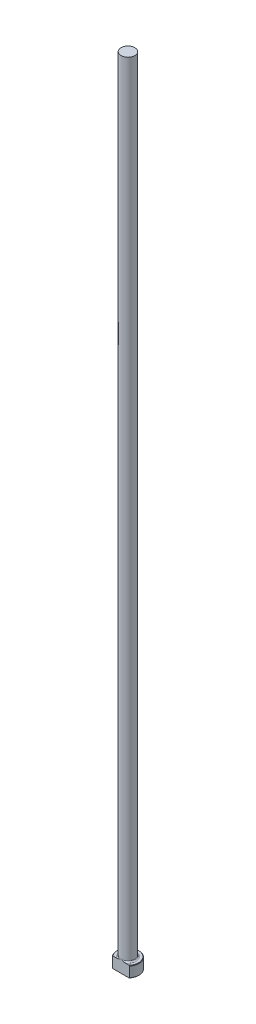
from build123d import *

# Parameters (mm, degrees)
CHAMFER1_SIZE = 0.254
FILLET1_R     = 0.762
KEY_DEPTH     = 458.28818594


with BuildPart() as part:
    # Sketch1 → Revolve1 (revolve)
    with BuildSketch(Plane.XY, mode=Mode.PRIVATE) as revolve1_sk:
        Polygon((0, 0), (-6.35, 0), (-6.35, 6.35), (-3.96875, 6.35), (-3.96875, 457.2), (0, 457.2), align=None)
    revolve(revolve1_sk.sketch.rotate(Axis((0, 259.958771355, 0), (0, -1, 0)), 270), axis=Axis((0, 259.958771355, 0), (0, -1, 0)))

    # Chamfer1
    chamfer1_edges = [part.edges().sort_by_distance(p)[0] for p in [
        (0, 6.35, -6.35),
        (0, 0, -6.35),
    ]]
    chamfer(chamfer1_edges, length=CHAMFER1_SIZE)

    # Fillet1
    fillet1_edges = [part.edges().sort_by_distance(p)[0] for p in [
        (0, 6.35, -3.96875),
    ]]
    fillet(fillet1_edges, radius=FILLET1_R)

    # Sketch2 → Key (cut, through all)
    with BuildSketch(Plane(origin=(0, 0, 0), x_dir=(1, 0, 0), z_dir=(0, 1, 0))):
        with BuildLine():
            Line((-4.956967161, -3.96875), (4.956967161, -3.96875))
            ThreePointArc((4.956967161, -3.96875), (0, -6.35), (-4.956967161, -3.96875))
        make_face()
    extrude(amount=KEY_DEPTH, mode=Mode.SUBTRACT)


solid = part.part
